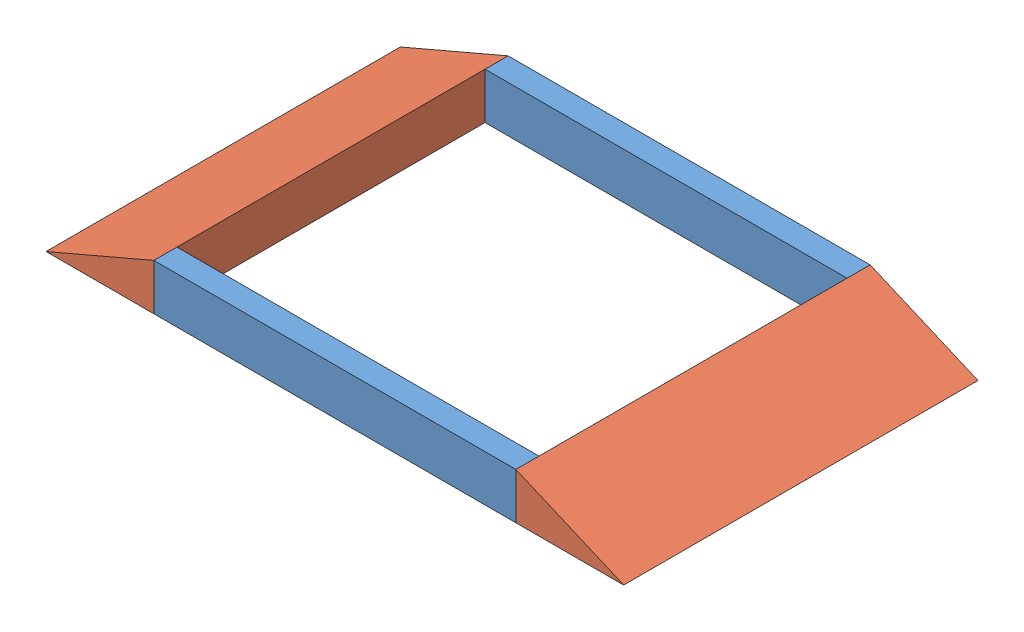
SolidWorks assembly Assem2.sldasm, configuration Default (file format 3400). Lengths in mm.
Overall size (476.25 38.1 292.1).
4 component instances, 2 part files, 9 mates.
Components (placement in the parent):
- channel-1: channel.SLDPRT [Default] at (-137.178 -50.5315 24.556) size (298.45 38.1 19.05)
- channel-2: channel.SLDPRT [Default] at (-137.178 -50.5315 -248.494) size (298.45 38.1 19.05)
- ramp-1: ramp.SLDPRT [Default] at (-137.178 -50.5315 -267.544) x (0 0 1) z (-1 0 0) size (292.1 38.1 88.9)
- ramp-2: ramp.SLDPRT [Default] at (161.272 -50.5315 24.556) x (0 0 -1) z (1 0 0) size (292.1 38.1 88.9)
Mates (geometry in assembly coordinates):
- Coincident1: coincident: plane of ?; plane of ?
- Coincident2: coincident: line of ?; line of ?
- Coincident3: coincident: point of ?; point of ?
- Coincident4: coincident: plane of ?; plane of ?
- Coincident5: coincident: line of ?; line of ?
- Coincident6: coincident: point of ?; point of ?
- Coincident7: coincident: plane of ?; plane of ?
- Coincident8: coincident: line of ?; line of ?
- Coincident9: coincident: point of ?; point of ?
